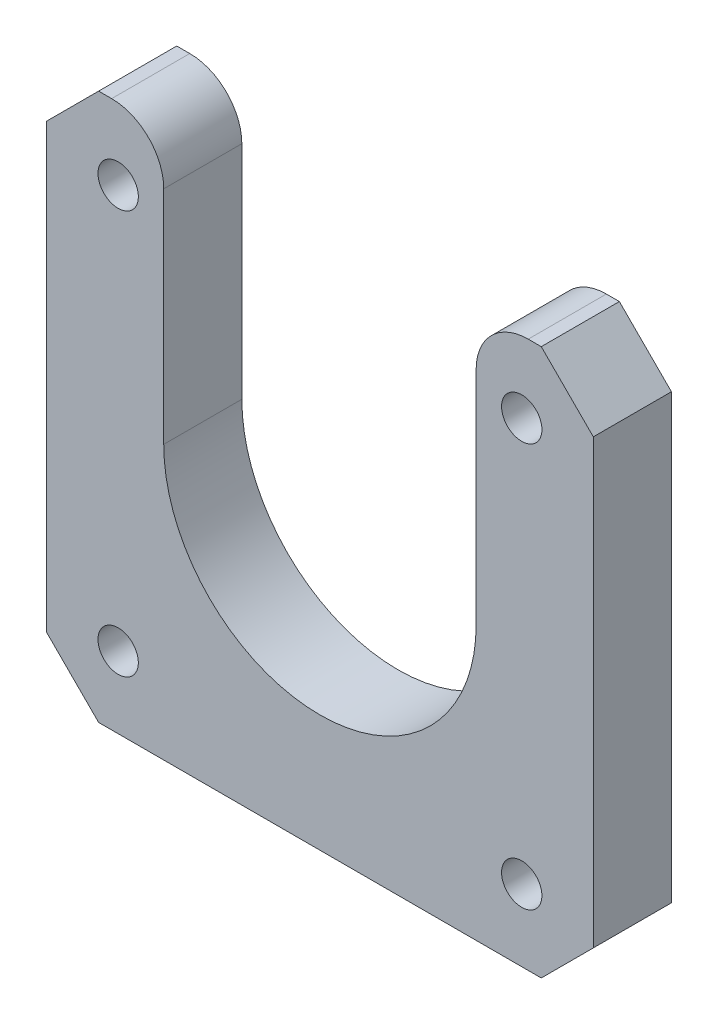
ISO-10303-21;
HEADER;
FILE_DESCRIPTION(('STEP AP214'),'2;1');
FILE_NAME('part.step','',(''),(''),'','','');
FILE_SCHEMA(('AUTOMOTIVE_DESIGN { 1 0 10303 214 1 1 1 1 }'));
ENDSEC;
DATA;
#1=APPLICATION_CONTEXT('core data for automotive mechanical design processes');
#2=APPLICATION_PROTOCOL_DEFINITION('international standard','automotive_design',2000,#1);
#3=PRODUCT_CONTEXT('',#1,'mechanical');
#4=PRODUCT('Part','Part','',(#3));
#5=PRODUCT_RELATED_PRODUCT_CATEGORY('part','',(#4));
#6=PRODUCT_DEFINITION_FORMATION('','',#4);
#7=PRODUCT_DEFINITION_CONTEXT('part definition',#1,'design');
#8=PRODUCT_DEFINITION('design','',#6,#7);
#9=PRODUCT_DEFINITION_SHAPE('','',#8);
#10=(LENGTH_UNIT() NAMED_UNIT(*) SI_UNIT(.MILLI.,.METRE.));
#11=(NAMED_UNIT(*) PLANE_ANGLE_UNIT() SI_UNIT($,.RADIAN.));
#12=(NAMED_UNIT(*) SI_UNIT($,.STERADIAN.) SOLID_ANGLE_UNIT());
#13=UNCERTAINTY_MEASURE_WITH_UNIT(LENGTH_MEASURE(1.E-05),#10,'distance_accuracy_value','');
#14=(GEOMETRIC_REPRESENTATION_CONTEXT(3) GLOBAL_UNCERTAINTY_ASSIGNED_CONTEXT((#13)) GLOBAL_UNIT_ASSIGNED_CONTEXT((#10,
#11,#12)) REPRESENTATION_CONTEXT('',''));
#15=CARTESIAN_POINT('',(0.,0.,0.));
#16=DIRECTION('',(0.,0.,1.));
#17=DIRECTION('',(1.,0.,0.));
#18=AXIS2_PLACEMENT_3D('',#15,#16,#17);
#19=CARTESIAN_POINT('',(0.,0.,6.));
#20=DIRECTION('',(0.,0.,1.));
#21=DIRECTION('',(1.,0.,0.));
#22=AXIS2_PLACEMENT_3D('',#19,#20,#21);
#23=PLANE('',#22);
#24=CARTESIAN_POINT('',(-15.5,-15.5,6.));
#25=DIRECTION('',(0.,0.,1.));
#26=DIRECTION('',(1.,0.,0.));
#27=AXIS2_PLACEMENT_3D('',#24,#25,#26);
#28=CIRCLE('',#27,1.55);
#29=CARTESIAN_POINT('',(-13.95,-15.5,6.));
#30=VERTEX_POINT('',#29);
#31=EDGE_CURVE('E297',#30,#30,#28,.T.);
#32=ORIENTED_EDGE('',*,*,#31,.F.);
#33=EDGE_LOOP('',(#32));
#34=FACE_BOUND('',#33,.T.);
#35=CARTESIAN_POINT('',(15.5,15.5,6.));
#36=DIRECTION('',(0.,0.,1.));
#37=DIRECTION('',(1.,0.,0.));
#38=AXIS2_PLACEMENT_3D('',#35,#36,#37);
#39=CIRCLE('',#38,1.55);
#40=CARTESIAN_POINT('',(17.05,15.5,6.));
#41=VERTEX_POINT('',#40);
#42=EDGE_CURVE('E176',#41,#41,#39,.T.);
#43=ORIENTED_EDGE('',*,*,#42,.F.);
#44=EDGE_LOOP('',(#43));
#45=FACE_BOUND('',#44,.T.);
#46=DIRECTION('',(-1.,0.,0.));
#47=VECTOR('',#46,1.);
#48=CARTESIAN_POINT('',(12.,21.,6.));
#49=LINE('',#48,#47);
#50=CARTESIAN_POINT('',(17.,21.,6.));
#51=VERTEX_POINT('',#50);
#52=CARTESIAN_POINT('',(16.,21.,6.));
#53=VERTEX_POINT('',#52);
#54=EDGE_CURVE('E143',#51,#53,#49,.T.);
#55=ORIENTED_EDGE('',*,*,#54,.T.);
#56=CARTESIAN_POINT('',(16.,17.,6.));
#57=DIRECTION('',(0.,0.,1.));
#58=DIRECTION('',(1.,0.,0.));
#59=AXIS2_PLACEMENT_3D('',#56,#57,#58);
#60=CIRCLE('',#59,4.);
#61=CARTESIAN_POINT('',(12.,17.,6.));
#62=VERTEX_POINT('',#61);
#63=EDGE_CURVE('E139',#53,#62,#60,.T.);
#64=ORIENTED_EDGE('',*,*,#63,.T.);
#65=DIRECTION('',(0.,-1.,0.));
#66=VECTOR('',#65,1.);
#67=CARTESIAN_POINT('',(12.,0.,6.));
#68=LINE('',#67,#66);
#69=CARTESIAN_POINT('',(12.,0.,6.));
#70=VERTEX_POINT('',#69);
#71=EDGE_CURVE('E131',#62,#70,#68,.T.);
#72=ORIENTED_EDGE('',*,*,#71,.T.);
#73=CARTESIAN_POINT('',(0.,0.,6.));
#74=DIRECTION('',(0.,0.,-1.));
#75=DIRECTION('',(1.,0.,0.));
#76=AXIS2_PLACEMENT_3D('',#73,#74,#75);
#77=CIRCLE('',#76,12.);
#78=CARTESIAN_POINT('',(-12.,0.,6.));
#79=VERTEX_POINT('',#78);
#80=EDGE_CURVE('E136',#70,#79,#77,.T.);
#81=ORIENTED_EDGE('',*,*,#80,.T.);
#82=DIRECTION('',(0.,1.,0.));
#83=VECTOR('',#82,1.);
#84=CARTESIAN_POINT('',(-12.,0.,6.));
#85=LINE('',#84,#83);
#86=CARTESIAN_POINT('',(-12.,17.,6.));
#87=VERTEX_POINT('',#86);
#88=EDGE_CURVE('E157',#79,#87,#85,.T.);
#89=ORIENTED_EDGE('',*,*,#88,.T.);
#90=CARTESIAN_POINT('',(-16.,17.,6.));
#91=DIRECTION('',(0.,0.,1.));
#92=DIRECTION('',(1.,0.,0.));
#93=AXIS2_PLACEMENT_3D('',#90,#91,#92);
#94=CIRCLE('',#93,4.);
#95=CARTESIAN_POINT('',(-16.,21.,6.));
#96=VERTEX_POINT('',#95);
#97=EDGE_CURVE('E47',#87,#96,#94,.T.);
#98=ORIENTED_EDGE('',*,*,#97,.T.);
#99=DIRECTION('',(-1.,0.,0.));
#100=VECTOR('',#99,1.);
#101=CARTESIAN_POINT('',(-21.,21.,6.));
#102=LINE('',#101,#100);
#103=CARTESIAN_POINT('',(-17.,21.,6.));
#104=VERTEX_POINT('',#103);
#105=EDGE_CURVE('E159',#96,#104,#102,.T.);
#106=ORIENTED_EDGE('',*,*,#105,.T.);
#107=DIRECTION('',(0.707106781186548,0.707106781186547,0.));
#108=VECTOR('',#107,1.);
#109=CARTESIAN_POINT('',(-19.,19.,6.));
#110=LINE('',#109,#108);
#111=CARTESIAN_POINT('',(-21.,17.,6.));
#112=VERTEX_POINT('',#111);
#113=EDGE_CURVE('E216',#104,#112,#110,.F.);
#114=ORIENTED_EDGE('',*,*,#113,.T.);
#115=DIRECTION('',(0.,-1.,0.));
#116=VECTOR('',#115,1.);
#117=CARTESIAN_POINT('',(-21.,-21.,6.));
#118=LINE('',#117,#116);
#119=CARTESIAN_POINT('',(-21.,-17.,6.));
#120=VERTEX_POINT('',#119);
#121=EDGE_CURVE('E164',#112,#120,#118,.T.);
#122=ORIENTED_EDGE('',*,*,#121,.T.);
#123=DIRECTION('',(-0.707106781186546,0.707106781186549,0.));
#124=VECTOR('',#123,1.);
#125=CARTESIAN_POINT('',(-19.,-19.,6.));
#126=LINE('',#125,#124);
#127=CARTESIAN_POINT('',(-17.,-21.,6.));
#128=VERTEX_POINT('',#127);
#129=EDGE_CURVE('E218',#120,#128,#126,.F.);
#130=ORIENTED_EDGE('',*,*,#129,.T.);
#131=DIRECTION('',(1.,0.,0.));
#132=VECTOR('',#131,1.);
#133=CARTESIAN_POINT('',(-21.,-21.,6.));
#134=LINE('',#133,#132);
#135=CARTESIAN_POINT('',(17.,-21.,6.));
#136=VERTEX_POINT('',#135);
#137=EDGE_CURVE('E167',#128,#136,#134,.T.);
#138=ORIENTED_EDGE('',*,*,#137,.T.);
#139=DIRECTION('',(-0.707106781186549,-0.707106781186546,0.));
#140=VECTOR('',#139,1.);
#141=CARTESIAN_POINT('',(19.,-19.,6.));
#142=LINE('',#141,#140);
#143=CARTESIAN_POINT('',(21.,-17.,6.));
#144=VERTEX_POINT('',#143);
#145=EDGE_CURVE('E214',#136,#144,#142,.F.);
#146=ORIENTED_EDGE('',*,*,#145,.T.);
#147=DIRECTION('',(0.,1.,0.));
#148=VECTOR('',#147,1.);
#149=CARTESIAN_POINT('',(21.,-21.,6.));
#150=LINE('',#149,#148);
#151=CARTESIAN_POINT('',(21.,17.,6.));
#152=VERTEX_POINT('',#151);
#153=EDGE_CURVE('E170',#144,#152,#150,.T.);
#154=ORIENTED_EDGE('',*,*,#153,.T.);
#155=DIRECTION('',(0.707106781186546,-0.707106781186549,0.));
#156=VECTOR('',#155,1.);
#157=CARTESIAN_POINT('',(19.,19.,6.));
#158=LINE('',#157,#156);
#159=EDGE_CURVE('E212',#152,#51,#158,.F.);
#160=ORIENTED_EDGE('',*,*,#159,.T.);
#161=EDGE_LOOP('',(#55,#64,#72,#81,#89,#98,#106,#114,#122,#130,#138,#146,#154,#160));
#162=FACE_BOUND('',#161,.T.);
#163=CARTESIAN_POINT('',(-15.5,15.5,6.));
#164=DIRECTION('',(0.,0.,1.));
#165=DIRECTION('',(-1.,0.,0.));
#166=AXIS2_PLACEMENT_3D('',#163,#164,#165);
#167=CIRCLE('',#166,1.55);
#168=CARTESIAN_POINT('',(-17.05,15.5,6.));
#169=VERTEX_POINT('',#168);
#170=EDGE_CURVE('E291',#169,#169,#167,.T.);
#171=ORIENTED_EDGE('',*,*,#170,.F.);
#172=EDGE_LOOP('',(#171));
#173=FACE_BOUND('',#172,.T.);
#174=CARTESIAN_POINT('',(15.5,-15.5,6.));
#175=DIRECTION('',(0.,0.,1.));
#176=DIRECTION('',(-1.,0.,0.));
#177=AXIS2_PLACEMENT_3D('',#174,#175,#176);
#178=CIRCLE('',#177,1.55);
#179=CARTESIAN_POINT('',(13.95,-15.5,6.));
#180=VERTEX_POINT('',#179);
#181=EDGE_CURVE('E303',#180,#180,#178,.T.);
#182=ORIENTED_EDGE('',*,*,#181,.F.);
#183=EDGE_LOOP('',(#182));
#184=FACE_BOUND('',#183,.T.);
#185=ADVANCED_FACE('F32',(#34,#45,#162,#173,#184),#23,.T.);
#186=CARTESIAN_POINT('',(0.,0.,0.));
#187=DIRECTION('',(0.,0.,1.));
#188=DIRECTION('',(1.,0.,0.));
#189=AXIS2_PLACEMENT_3D('',#186,#187,#188);
#190=PLANE('',#189);
#191=DIRECTION('',(0.,-1.,0.));
#192=VECTOR('',#191,1.);
#193=CARTESIAN_POINT('',(12.,0.,0.));
#194=LINE('',#193,#192);
#195=CARTESIAN_POINT('',(12.,17.,0.));
#196=VERTEX_POINT('',#195);
#197=CARTESIAN_POINT('',(12.,0.,0.));
#198=VERTEX_POINT('',#197);
#199=EDGE_CURVE('E149',#196,#198,#194,.T.);
#200=ORIENTED_EDGE('',*,*,#199,.F.);
#201=CARTESIAN_POINT('',(16.,17.,0.));
#202=DIRECTION('',(0.,0.,1.));
#203=DIRECTION('',(1.,0.,0.));
#204=AXIS2_PLACEMENT_3D('',#201,#202,#203);
#205=CIRCLE('',#204,4.);
#206=CARTESIAN_POINT('',(16.,21.,0.));
#207=VERTEX_POINT('',#206);
#208=EDGE_CURVE('E235',#196,#207,#205,.F.);
#209=ORIENTED_EDGE('',*,*,#208,.T.);
#210=DIRECTION('',(-1.,0.,0.));
#211=VECTOR('',#210,1.);
#212=CARTESIAN_POINT('',(12.,21.,0.));
#213=LINE('',#212,#211);
#214=CARTESIAN_POINT('',(17.,21.,0.));
#215=VERTEX_POINT('',#214);
#216=EDGE_CURVE('E173',#215,#207,#213,.T.);
#217=ORIENTED_EDGE('',*,*,#216,.F.);
#218=DIRECTION('',(-0.707106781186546,0.707106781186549,0.));
#219=VECTOR('',#218,1.);
#220=CARTESIAN_POINT('',(17.,21.,0.));
#221=LINE('',#220,#219);
#222=CARTESIAN_POINT('',(21.,17.,0.));
#223=VERTEX_POINT('',#222);
#224=EDGE_CURVE('E198',#215,#223,#221,.F.);
#225=ORIENTED_EDGE('',*,*,#224,.T.);
#226=DIRECTION('',(0.,1.,0.));
#227=VECTOR('',#226,1.);
#228=CARTESIAN_POINT('',(21.,-21.,0.));
#229=LINE('',#228,#227);
#230=CARTESIAN_POINT('',(21.,-17.,0.));
#231=VERTEX_POINT('',#230);
#232=EDGE_CURVE('E190',#231,#223,#229,.T.);
#233=ORIENTED_EDGE('',*,*,#232,.F.);
#234=DIRECTION('',(0.707106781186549,0.707106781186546,0.));
#235=VECTOR('',#234,1.);
#236=CARTESIAN_POINT('',(21.,-17.,0.));
#237=LINE('',#236,#235);
#238=CARTESIAN_POINT('',(17.,-21.,0.));
#239=VERTEX_POINT('',#238);
#240=EDGE_CURVE('E200',#231,#239,#237,.F.);
#241=ORIENTED_EDGE('',*,*,#240,.T.);
#242=DIRECTION('',(1.,0.,0.));
#243=VECTOR('',#242,1.);
#244=CARTESIAN_POINT('',(-21.,-21.,0.));
#245=LINE('',#244,#243);
#246=CARTESIAN_POINT('',(-17.,-21.,0.));
#247=VERTEX_POINT('',#246);
#248=EDGE_CURVE('E187',#247,#239,#245,.T.);
#249=ORIENTED_EDGE('',*,*,#248,.F.);
#250=DIRECTION('',(0.707106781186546,-0.707106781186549,0.));
#251=VECTOR('',#250,1.);
#252=CARTESIAN_POINT('',(-17.,-21.,0.));
#253=LINE('',#252,#251);
#254=CARTESIAN_POINT('',(-21.,-17.,0.));
#255=VERTEX_POINT('',#254);
#256=EDGE_CURVE('E205',#247,#255,#253,.F.);
#257=ORIENTED_EDGE('',*,*,#256,.T.);
#258=DIRECTION('',(0.,-1.,0.));
#259=VECTOR('',#258,1.);
#260=CARTESIAN_POINT('',(-21.,-21.,0.));
#261=LINE('',#260,#259);
#262=CARTESIAN_POINT('',(-21.,17.,0.));
#263=VERTEX_POINT('',#262);
#264=EDGE_CURVE('E184',#263,#255,#261,.T.);
#265=ORIENTED_EDGE('',*,*,#264,.F.);
#266=DIRECTION('',(-0.707106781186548,-0.707106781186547,0.));
#267=VECTOR('',#266,1.);
#268=CARTESIAN_POINT('',(-21.,17.,0.));
#269=LINE('',#268,#267);
#270=CARTESIAN_POINT('',(-17.,21.,0.));
#271=VERTEX_POINT('',#270);
#272=EDGE_CURVE('E202',#263,#271,#269,.F.);
#273=ORIENTED_EDGE('',*,*,#272,.T.);
#274=DIRECTION('',(-1.,0.,0.));
#275=VECTOR('',#274,1.);
#276=CARTESIAN_POINT('',(-21.,21.,0.));
#277=LINE('',#276,#275);
#278=CARTESIAN_POINT('',(-16.,21.,0.));
#279=VERTEX_POINT('',#278);
#280=EDGE_CURVE('E182',#279,#271,#277,.T.);
#281=ORIENTED_EDGE('',*,*,#280,.F.);
#282=CARTESIAN_POINT('',(-16.,17.,0.));
#283=DIRECTION('',(0.,0.,1.));
#284=DIRECTION('',(1.,0.,0.));
#285=AXIS2_PLACEMENT_3D('',#282,#283,#284);
#286=CIRCLE('',#285,4.);
#287=CARTESIAN_POINT('',(-12.,17.,0.));
#288=VERTEX_POINT('',#287);
#289=EDGE_CURVE('E233',#279,#288,#286,.F.);
#290=ORIENTED_EDGE('',*,*,#289,.T.);
#291=DIRECTION('',(0.,1.,0.));
#292=VECTOR('',#291,1.);
#293=CARTESIAN_POINT('',(-12.,0.,0.));
#294=LINE('',#293,#292);
#295=CARTESIAN_POINT('',(-12.,0.,0.));
#296=VERTEX_POINT('',#295);
#297=EDGE_CURVE('E180',#296,#288,#294,.T.);
#298=ORIENTED_EDGE('',*,*,#297,.F.);
#299=CARTESIAN_POINT('',(0.,0.,0.));
#300=DIRECTION('',(0.,0.,-1.));
#301=DIRECTION('',(1.,0.,0.));
#302=AXIS2_PLACEMENT_3D('',#299,#300,#301);
#303=CIRCLE('',#302,12.);
#304=EDGE_CURVE('E178',#198,#296,#303,.T.);
#305=ORIENTED_EDGE('',*,*,#304,.F.);
#306=EDGE_LOOP('',(#200,#209,#217,#225,#233,#241,#249,#257,#265,#273,#281,#290,#298,#305));
#307=FACE_BOUND('',#306,.T.);
#308=CARTESIAN_POINT('',(15.5,15.5,0.));
#309=DIRECTION('',(0.,0.,1.));
#310=DIRECTION('',(1.,0.,0.));
#311=AXIS2_PLACEMENT_3D('',#308,#309,#310);
#312=CIRCLE('',#311,1.55);
#313=CARTESIAN_POINT('',(17.05,15.5,0.));
#314=VERTEX_POINT('',#313);
#315=EDGE_CURVE('E288',#314,#314,#312,.T.);
#316=ORIENTED_EDGE('',*,*,#315,.T.);
#317=EDGE_LOOP('',(#316));
#318=FACE_BOUND('',#317,.T.);
#319=CARTESIAN_POINT('',(-15.5,15.5,0.));
#320=DIRECTION('',(0.,0.,1.));
#321=DIRECTION('',(-1.,0.,0.));
#322=AXIS2_PLACEMENT_3D('',#319,#320,#321);
#323=CIRCLE('',#322,1.55);
#324=CARTESIAN_POINT('',(-17.05,15.5,0.));
#325=VERTEX_POINT('',#324);
#326=EDGE_CURVE('E294',#325,#325,#323,.T.);
#327=ORIENTED_EDGE('',*,*,#326,.T.);
#328=EDGE_LOOP('',(#327));
#329=FACE_BOUND('',#328,.T.);
#330=CARTESIAN_POINT('',(-15.5,-15.5,0.));
#331=DIRECTION('',(0.,0.,1.));
#332=DIRECTION('',(1.,0.,0.));
#333=AXIS2_PLACEMENT_3D('',#330,#331,#332);
#334=CIRCLE('',#333,1.55);
#335=CARTESIAN_POINT('',(-13.95,-15.5,0.));
#336=VERTEX_POINT('',#335);
#337=EDGE_CURVE('E300',#336,#336,#334,.T.);
#338=ORIENTED_EDGE('',*,*,#337,.T.);
#339=EDGE_LOOP('',(#338));
#340=FACE_BOUND('',#339,.T.);
#341=CARTESIAN_POINT('',(15.5,-15.5,0.));
#342=DIRECTION('',(0.,0.,1.));
#343=DIRECTION('',(-1.,0.,0.));
#344=AXIS2_PLACEMENT_3D('',#341,#342,#343);
#345=CIRCLE('',#344,1.55);
#346=CARTESIAN_POINT('',(13.95,-15.5,0.));
#347=VERTEX_POINT('',#346);
#348=EDGE_CURVE('E306',#347,#347,#345,.T.);
#349=ORIENTED_EDGE('',*,*,#348,.T.);
#350=EDGE_LOOP('',(#349));
#351=FACE_BOUND('',#350,.T.);
#352=ADVANCED_FACE('F247',(#307,#318,#329,#340,#351),#190,.F.);
#353=CARTESIAN_POINT('',(12.,21.,6.));
#354=DIRECTION('',(0.,-1.,0.));
#355=DIRECTION('',(1.,0.,0.));
#356=AXIS2_PLACEMENT_3D('',#353,#354,#355);
#357=PLANE('',#356);
#358=ORIENTED_EDGE('',*,*,#216,.T.);
#359=DIRECTION('',(0.,0.,-1.));
#360=VECTOR('',#359,1.);
#361=CARTESIAN_POINT('',(16.,21.,6.));
#362=LINE('',#361,#360);
#363=EDGE_CURVE('E237',#207,#53,#362,.F.);
#364=ORIENTED_EDGE('',*,*,#363,.T.);
#365=ORIENTED_EDGE('',*,*,#54,.F.);
#366=DIRECTION('',(0.,0.,-1.));
#367=VECTOR('',#366,1.);
#368=CARTESIAN_POINT('',(17.,21.,6.));
#369=LINE('',#368,#367);
#370=EDGE_CURVE('E228',#51,#215,#369,.T.);
#371=ORIENTED_EDGE('',*,*,#370,.T.);
#372=EDGE_LOOP('',(#358,#364,#365,#371));
#373=FACE_BOUND('',#372,.T.);
#374=ADVANCED_FACE('F284',(#373),#357,.F.);
#375=CARTESIAN_POINT('',(12.,0.,6.));
#376=DIRECTION('',(1.,0.,0.));
#377=DIRECTION('',(0.,1.,0.));
#378=AXIS2_PLACEMENT_3D('',#375,#376,#377);
#379=PLANE('',#378);
#380=ORIENTED_EDGE('',*,*,#71,.F.);
#381=DIRECTION('',(0.,0.,-1.));
#382=VECTOR('',#381,1.);
#383=CARTESIAN_POINT('',(12.,17.,6.));
#384=LINE('',#383,#382);
#385=EDGE_CURVE('E231',#62,#196,#384,.T.);
#386=ORIENTED_EDGE('',*,*,#385,.T.);
#387=ORIENTED_EDGE('',*,*,#199,.T.);
#388=DIRECTION('',(0.,0.,-1.));
#389=VECTOR('',#388,1.);
#390=CARTESIAN_POINT('',(12.,0.,6.));
#391=LINE('',#390,#389);
#392=EDGE_CURVE('E146',#70,#198,#391,.T.);
#393=ORIENTED_EDGE('',*,*,#392,.F.);
#394=EDGE_LOOP('',(#380,#386,#387,#393));
#395=FACE_BOUND('',#394,.T.);
#396=ADVANCED_FACE('F147',(#395),#379,.F.);
#397=CARTESIAN_POINT('',(0.,0.,6.));
#398=DIRECTION('',(0.,0.,-1.));
#399=DIRECTION('',(-1.,0.,0.));
#400=AXIS2_PLACEMENT_3D('',#397,#398,#399);
#401=CYLINDRICAL_SURFACE('',#400,12.);
#402=ORIENTED_EDGE('',*,*,#304,.T.);
#403=DIRECTION('',(0.,0.,-1.));
#404=VECTOR('',#403,1.);
#405=CARTESIAN_POINT('',(-12.,0.,6.));
#406=LINE('',#405,#404);
#407=EDGE_CURVE('E153',#79,#296,#406,.T.);
#408=ORIENTED_EDGE('',*,*,#407,.F.);
#409=ORIENTED_EDGE('',*,*,#80,.F.);
#410=ORIENTED_EDGE('',*,*,#392,.T.);
#411=EDGE_LOOP('',(#402,#408,#409,#410));
#412=FACE_BOUND('',#411,.T.);
#413=ADVANCED_FACE('F155',(#412),#401,.F.);
#414=CARTESIAN_POINT('',(-12.,0.,6.));
#415=DIRECTION('',(-1.,0.,0.));
#416=DIRECTION('',(0.,-1.,0.));
#417=AXIS2_PLACEMENT_3D('',#414,#415,#416);
#418=PLANE('',#417);
#419=ORIENTED_EDGE('',*,*,#297,.T.);
#420=DIRECTION('',(0.,0.,-1.));
#421=VECTOR('',#420,1.);
#422=CARTESIAN_POINT('',(-12.,17.,6.));
#423=LINE('',#422,#421);
#424=EDGE_CURVE('E11',#288,#87,#423,.F.);
#425=ORIENTED_EDGE('',*,*,#424,.T.);
#426=ORIENTED_EDGE('',*,*,#88,.F.);
#427=ORIENTED_EDGE('',*,*,#407,.T.);
#428=EDGE_LOOP('',(#419,#425,#426,#427));
#429=FACE_BOUND('',#428,.T.);
#430=ADVANCED_FACE('F336',(#429),#418,.F.);
#431=CARTESIAN_POINT('',(-21.,21.,6.));
#432=DIRECTION('',(0.,-1.,0.));
#433=DIRECTION('',(1.,0.,0.));
#434=AXIS2_PLACEMENT_3D('',#431,#432,#433);
#435=PLANE('',#434);
#436=ORIENTED_EDGE('',*,*,#105,.F.);
#437=DIRECTION('',(0.,0.,-1.));
#438=VECTOR('',#437,1.);
#439=CARTESIAN_POINT('',(-16.,21.,6.));
#440=LINE('',#439,#438);
#441=EDGE_CURVE('E40',#96,#279,#440,.T.);
#442=ORIENTED_EDGE('',*,*,#441,.T.);
#443=ORIENTED_EDGE('',*,*,#280,.T.);
#444=DIRECTION('',(0.,0.,1.));
#445=VECTOR('',#444,1.);
#446=CARTESIAN_POINT('',(-17.,21.,6.));
#447=LINE('',#446,#445);
#448=EDGE_CURVE('E220',#271,#104,#447,.T.);
#449=ORIENTED_EDGE('',*,*,#448,.T.);
#450=EDGE_LOOP('',(#436,#442,#443,#449));
#451=FACE_BOUND('',#450,.T.);
#452=ADVANCED_FACE('F244',(#451),#435,.F.);
#453=CARTESIAN_POINT('',(-21.,-21.,6.));
#454=DIRECTION('',(1.,0.,0.));
#455=DIRECTION('',(0.,0.,-1.));
#456=AXIS2_PLACEMENT_3D('',#453,#454,#455);
#457=PLANE('',#456);
#458=ORIENTED_EDGE('',*,*,#264,.T.);
#459=DIRECTION('',(0.,0.,1.));
#460=VECTOR('',#459,1.);
#461=CARTESIAN_POINT('',(-21.,-17.,6.));
#462=LINE('',#461,#460);
#463=EDGE_CURVE('E210',#255,#120,#462,.T.);
#464=ORIENTED_EDGE('',*,*,#463,.T.);
#465=ORIENTED_EDGE('',*,*,#121,.F.);
#466=DIRECTION('',(0.,0.,-1.));
#467=VECTOR('',#466,1.);
#468=CARTESIAN_POINT('',(-21.,17.,6.));
#469=LINE('',#468,#467);
#470=EDGE_CURVE('E207',#112,#263,#469,.T.);
#471=ORIENTED_EDGE('',*,*,#470,.T.);
#472=EDGE_LOOP('',(#458,#464,#465,#471));
#473=FACE_BOUND('',#472,.T.);
#474=ADVANCED_FACE('F259',(#473),#457,.F.);
#475=CARTESIAN_POINT('',(-21.,-21.,6.));
#476=DIRECTION('',(0.,1.,0.));
#477=DIRECTION('',(0.,0.,1.));
#478=AXIS2_PLACEMENT_3D('',#475,#476,#477);
#479=PLANE('',#478);
#480=ORIENTED_EDGE('',*,*,#137,.F.);
#481=DIRECTION('',(0.,0.,-1.));
#482=VECTOR('',#481,1.);
#483=CARTESIAN_POINT('',(-17.,-21.,6.));
#484=LINE('',#483,#482);
#485=EDGE_CURVE('E195',#128,#247,#484,.T.);
#486=ORIENTED_EDGE('',*,*,#485,.T.);
#487=ORIENTED_EDGE('',*,*,#248,.T.);
#488=DIRECTION('',(0.,0.,1.));
#489=VECTOR('',#488,1.);
#490=CARTESIAN_POINT('',(17.,-21.,6.));
#491=LINE('',#490,#489);
#492=EDGE_CURVE('E152',#239,#136,#491,.T.);
#493=ORIENTED_EDGE('',*,*,#492,.T.);
#494=EDGE_LOOP('',(#480,#486,#487,#493));
#495=FACE_BOUND('',#494,.T.);
#496=ADVANCED_FACE('F267',(#495),#479,.F.);
#497=CARTESIAN_POINT('',(21.,-21.,6.));
#498=DIRECTION('',(-1.,0.,0.));
#499=DIRECTION('',(0.,0.,1.));
#500=AXIS2_PLACEMENT_3D('',#497,#498,#499);
#501=PLANE('',#500);
#502=ORIENTED_EDGE('',*,*,#153,.F.);
#503=DIRECTION('',(0.,0.,-1.));
#504=VECTOR('',#503,1.);
#505=CARTESIAN_POINT('',(21.,-17.,6.));
#506=LINE('',#505,#504);
#507=EDGE_CURVE('E225',#144,#231,#506,.T.);
#508=ORIENTED_EDGE('',*,*,#507,.T.);
#509=ORIENTED_EDGE('',*,*,#232,.T.);
#510=DIRECTION('',(0.,0.,1.));
#511=VECTOR('',#510,1.);
#512=CARTESIAN_POINT('',(21.,17.,6.));
#513=LINE('',#512,#511);
#514=EDGE_CURVE('E223',#223,#152,#513,.T.);
#515=ORIENTED_EDGE('',*,*,#514,.T.);
#516=EDGE_LOOP('',(#502,#508,#509,#515));
#517=FACE_BOUND('',#516,.T.);
#518=ADVANCED_FACE('F276',(#517),#501,.F.);
#519=CARTESIAN_POINT('',(15.5,15.5,6.));
#520=DIRECTION('',(0.,0.,-1.));
#521=DIRECTION('',(-1.,0.,0.));
#522=AXIS2_PLACEMENT_3D('',#519,#520,#521);
#523=CYLINDRICAL_SURFACE('',#522,1.55);
#524=ORIENTED_EDGE('',*,*,#42,.T.);
#525=EDGE_LOOP('',(#524));
#526=FACE_BOUND('',#525,.T.);
#527=ORIENTED_EDGE('',*,*,#315,.F.);
#528=EDGE_LOOP('',(#527));
#529=FACE_BOUND('',#528,.T.);
#530=ADVANCED_FACE('F325',(#526,#529),#523,.F.);
#531=CARTESIAN_POINT('',(-15.5,15.5,6.));
#532=DIRECTION('',(0.,0.,-1.));
#533=DIRECTION('',(-1.,0.,0.));
#534=AXIS2_PLACEMENT_3D('',#531,#532,#533);
#535=CYLINDRICAL_SURFACE('',#534,1.55);
#536=ORIENTED_EDGE('',*,*,#170,.T.);
#537=EDGE_LOOP('',(#536));
#538=FACE_BOUND('',#537,.T.);
#539=ORIENTED_EDGE('',*,*,#326,.F.);
#540=EDGE_LOOP('',(#539));
#541=FACE_BOUND('',#540,.T.);
#542=ADVANCED_FACE('F461',(#538,#541),#535,.F.);
#543=CARTESIAN_POINT('',(-15.5,-15.5,6.));
#544=DIRECTION('',(0.,0.,-1.));
#545=DIRECTION('',(-1.,0.,0.));
#546=AXIS2_PLACEMENT_3D('',#543,#544,#545);
#547=CYLINDRICAL_SURFACE('',#546,1.55);
#548=ORIENTED_EDGE('',*,*,#31,.T.);
#549=EDGE_LOOP('',(#548));
#550=FACE_BOUND('',#549,.T.);
#551=ORIENTED_EDGE('',*,*,#337,.F.);
#552=EDGE_LOOP('',(#551));
#553=FACE_BOUND('',#552,.T.);
#554=ADVANCED_FACE('F452',(#550,#553),#547,.F.);
#555=CARTESIAN_POINT('',(15.5,-15.5,6.));
#556=DIRECTION('',(0.,0.,-1.));
#557=DIRECTION('',(-1.,0.,0.));
#558=AXIS2_PLACEMENT_3D('',#555,#556,#557);
#559=CYLINDRICAL_SURFACE('',#558,1.55);
#560=ORIENTED_EDGE('',*,*,#181,.T.);
#561=EDGE_LOOP('',(#560));
#562=FACE_BOUND('',#561,.T.);
#563=ORIENTED_EDGE('',*,*,#348,.F.);
#564=EDGE_LOOP('',(#563));
#565=FACE_BOUND('',#564,.T.);
#566=ADVANCED_FACE('F312',(#562,#565),#559,.F.);
#567=CARTESIAN_POINT('',(-17.,-21.,6.));
#568=DIRECTION('',(0.707106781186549,0.707106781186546,0.));
#569=DIRECTION('',(0.,0.,-1.));
#570=AXIS2_PLACEMENT_3D('',#567,#568,#569);
#571=PLANE('',#570);
#572=ORIENTED_EDGE('',*,*,#129,.F.);
#573=ORIENTED_EDGE('',*,*,#463,.F.);
#574=ORIENTED_EDGE('',*,*,#256,.F.);
#575=ORIENTED_EDGE('',*,*,#485,.F.);
#576=EDGE_LOOP('',(#572,#573,#574,#575));
#577=FACE_BOUND('',#576,.T.);
#578=ADVANCED_FACE('F262',(#577),#571,.F.);
#579=CARTESIAN_POINT('',(-21.,17.,6.));
#580=DIRECTION('',(0.707106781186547,-0.707106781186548,0.));
#581=DIRECTION('',(0.,0.,-1.));
#582=AXIS2_PLACEMENT_3D('',#579,#580,#581);
#583=PLANE('',#582);
#584=ORIENTED_EDGE('',*,*,#113,.F.);
#585=ORIENTED_EDGE('',*,*,#448,.F.);
#586=ORIENTED_EDGE('',*,*,#272,.F.);
#587=ORIENTED_EDGE('',*,*,#470,.F.);
#588=EDGE_LOOP('',(#584,#585,#586,#587));
#589=FACE_BOUND('',#588,.T.);
#590=ADVANCED_FACE('F255',(#589),#583,.F.);
#591=CARTESIAN_POINT('',(21.,-17.,6.));
#592=DIRECTION('',(-0.707106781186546,0.707106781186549,0.));
#593=DIRECTION('',(0.,0.,-1.));
#594=AXIS2_PLACEMENT_3D('',#591,#592,#593);
#595=PLANE('',#594);
#596=ORIENTED_EDGE('',*,*,#145,.F.);
#597=ORIENTED_EDGE('',*,*,#492,.F.);
#598=ORIENTED_EDGE('',*,*,#240,.F.);
#599=ORIENTED_EDGE('',*,*,#507,.F.);
#600=EDGE_LOOP('',(#596,#597,#598,#599));
#601=FACE_BOUND('',#600,.T.);
#602=ADVANCED_FACE('F271',(#601),#595,.F.);
#603=CARTESIAN_POINT('',(17.,21.,6.));
#604=DIRECTION('',(-0.707106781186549,-0.707106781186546,0.));
#605=DIRECTION('',(0.,0.,-1.));
#606=AXIS2_PLACEMENT_3D('',#603,#604,#605);
#607=PLANE('',#606);
#608=ORIENTED_EDGE('',*,*,#159,.F.);
#609=ORIENTED_EDGE('',*,*,#514,.F.);
#610=ORIENTED_EDGE('',*,*,#224,.F.);
#611=ORIENTED_EDGE('',*,*,#370,.F.);
#612=EDGE_LOOP('',(#608,#609,#610,#611));
#613=FACE_BOUND('',#612,.T.);
#614=ADVANCED_FACE('F280',(#613),#607,.F.);
#615=CARTESIAN_POINT('',(16.,17.,6.));
#616=DIRECTION('',(0.,0.,-1.));
#617=DIRECTION('',(-1.,0.,0.));
#618=AXIS2_PLACEMENT_3D('',#615,#616,#617);
#619=CYLINDRICAL_SURFACE('',#618,4.);
#620=ORIENTED_EDGE('',*,*,#63,.F.);
#621=ORIENTED_EDGE('',*,*,#363,.F.);
#622=ORIENTED_EDGE('',*,*,#208,.F.);
#623=ORIENTED_EDGE('',*,*,#385,.F.);
#624=EDGE_LOOP('',(#620,#621,#622,#623));
#625=FACE_BOUND('',#624,.T.);
#626=ADVANCED_FACE('F352',(#625),#619,.T.);
#627=CARTESIAN_POINT('',(-16.,17.,6.));
#628=DIRECTION('',(0.,0.,-1.));
#629=DIRECTION('',(-1.,0.,0.));
#630=AXIS2_PLACEMENT_3D('',#627,#628,#629);
#631=CYLINDRICAL_SURFACE('',#630,4.);
#632=ORIENTED_EDGE('',*,*,#97,.F.);
#633=ORIENTED_EDGE('',*,*,#424,.F.);
#634=ORIENTED_EDGE('',*,*,#289,.F.);
#635=ORIENTED_EDGE('',*,*,#441,.F.);
#636=EDGE_LOOP('',(#632,#633,#634,#635));
#637=FACE_BOUND('',#636,.T.);
#638=ADVANCED_FACE('F34',(#637),#631,.T.);
#639=CLOSED_SHELL('',(#185,#352,#374,#396,#413,#430,#452,#474,#496,#518,#530,#542,#554,#566,
#578,#590,#602,#614,#626,#638));
#640=MANIFOLD_SOLID_BREP('B2',#639);
#641=ADVANCED_BREP_SHAPE_REPRESENTATION('',(#18,#640),#14);
#642=SHAPE_DEFINITION_REPRESENTATION(#9,#641);
ENDSEC;
END-ISO-10303-21;
